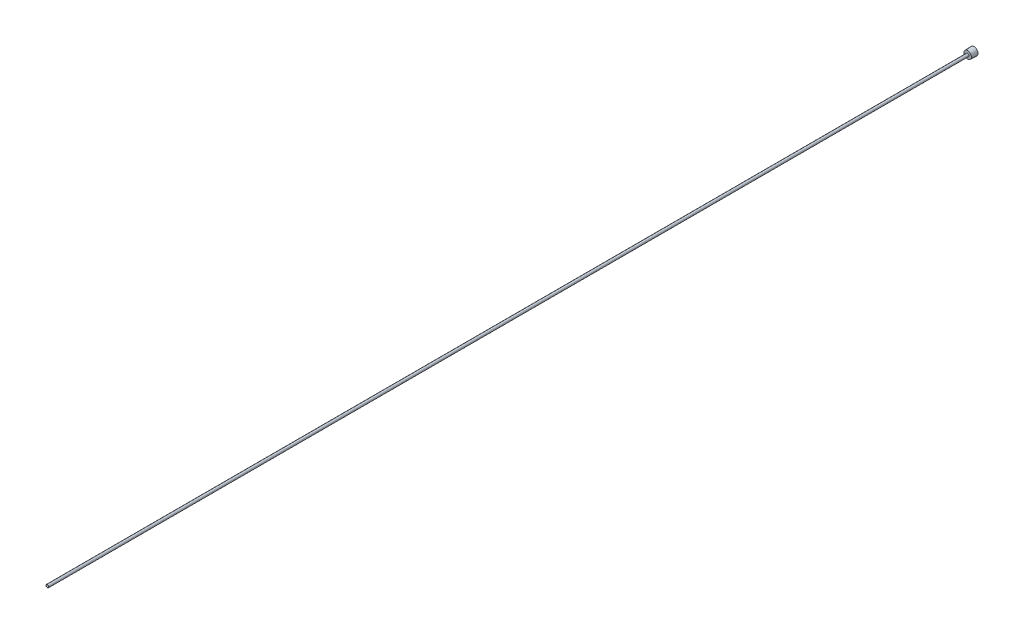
ISO-10303-21;
HEADER;
FILE_DESCRIPTION(('STEP AP214'),'2;1');
FILE_NAME('part.step','',(''),(''),'','','');
FILE_SCHEMA(('AUTOMOTIVE_DESIGN { 1 0 10303 214 1 1 1 1 }'));
ENDSEC;
DATA;
#1=APPLICATION_CONTEXT('core data for automotive mechanical design processes');
#2=APPLICATION_PROTOCOL_DEFINITION('international standard','automotive_design',2000,#1);
#3=PRODUCT_CONTEXT('',#1,'mechanical');
#4=PRODUCT('Part','Part','',(#3));
#5=PRODUCT_RELATED_PRODUCT_CATEGORY('part','',(#4));
#6=PRODUCT_DEFINITION_FORMATION('','',#4);
#7=PRODUCT_DEFINITION_CONTEXT('part definition',#1,'design');
#8=PRODUCT_DEFINITION('design','',#6,#7);
#9=PRODUCT_DEFINITION_SHAPE('','',#8);
#10=(LENGTH_UNIT() NAMED_UNIT(*) SI_UNIT(.MILLI.,.METRE.));
#11=(NAMED_UNIT(*) PLANE_ANGLE_UNIT() SI_UNIT($,.RADIAN.));
#12=(NAMED_UNIT(*) SI_UNIT($,.STERADIAN.) SOLID_ANGLE_UNIT());
#13=UNCERTAINTY_MEASURE_WITH_UNIT(LENGTH_MEASURE(1.E-05),#10,'distance_accuracy_value','');
#14=(GEOMETRIC_REPRESENTATION_CONTEXT(3) GLOBAL_UNCERTAINTY_ASSIGNED_CONTEXT((#13)) GLOBAL_UNIT_ASSIGNED_CONTEXT((#10,
#11,#12)) REPRESENTATION_CONTEXT('',''));
#15=CARTESIAN_POINT('',(0.,0.,0.));
#16=DIRECTION('',(0.,0.,1.));
#17=DIRECTION('',(1.,0.,0.));
#18=AXIS2_PLACEMENT_3D('',#15,#16,#17);
#19=CARTESIAN_POINT('',(0.,0.,0.));
#20=DIRECTION('',(0.,0.,1.));
#21=DIRECTION('',(1.,0.,0.));
#22=AXIS2_PLACEMENT_3D('',#19,#20,#21);
#23=CYLINDRICAL_SURFACE('',#22,1.2065);
#24=CARTESIAN_POINT('',(0.,0.,914.4));
#25=DIRECTION('',(0.,0.,1.));
#26=DIRECTION('',(1.,0.,0.));
#27=AXIS2_PLACEMENT_3D('',#24,#25,#26);
#28=CIRCLE('',#27,1.2065);
#29=CARTESIAN_POINT('',(1.2065,0.,914.4));
#30=VERTEX_POINT('',#29);
#31=EDGE_CURVE('E142',#30,#30,#28,.T.);
#32=ORIENTED_EDGE('',*,*,#31,.T.);
#33=EDGE_LOOP('',(#32));
#34=FACE_BOUND('',#33,.T.);
#35=CARTESIAN_POINT('',(0.,0.,3.96875));
#36=DIRECTION('',(0.,0.,-1.));
#37=DIRECTION('',(-1.,0.,0.));
#38=AXIS2_PLACEMENT_3D('',#35,#36,#37);
#39=CIRCLE('',#38,1.2065);
#40=CARTESIAN_POINT('',(-1.2065,0.,3.96875));
#41=VERTEX_POINT('',#40);
#42=EDGE_CURVE('E37',#41,#41,#39,.F.);
#43=ORIENTED_EDGE('',*,*,#42,.F.);
#44=EDGE_LOOP('',(#43));
#45=FACE_BOUND('',#44,.T.);
#46=ADVANCED_FACE('F33',(#34,#45),#23,.F.);
#47=CARTESIAN_POINT('',(0.,0.,0.));
#48=DIRECTION('',(0.,0.,1.));
#49=DIRECTION('',(1.,0.,0.));
#50=AXIS2_PLACEMENT_3D('',#47,#48,#49);
#51=PLANE('',#50);
#52=DIRECTION('',(-0.866025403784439,0.5,0.));
#53=VECTOR('',#52,1.);
#54=CARTESIAN_POINT('',(0.,-2.7569630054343,0.));
#55=LINE('',#54,#53);
#56=CARTESIAN_POINT('',(0.,-2.7569630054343,0.));
#57=VERTEX_POINT('',#56);
#58=CARTESIAN_POINT('',(-2.3876,-1.37848150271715,0.));
#59=VERTEX_POINT('',#58);
#60=EDGE_CURVE('E124',#57,#59,#55,.T.);
#61=ORIENTED_EDGE('',*,*,#60,.F.);
#62=DIRECTION('',(-0.866025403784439,-0.5,0.));
#63=VECTOR('',#62,1.);
#64=CARTESIAN_POINT('',(2.3876,-1.37848150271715,0.));
#65=LINE('',#64,#63);
#66=CARTESIAN_POINT('',(2.3876,-1.37848150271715,0.));
#67=VERTEX_POINT('',#66);
#68=EDGE_CURVE('E49',#67,#57,#65,.T.);
#69=ORIENTED_EDGE('',*,*,#68,.F.);
#70=DIRECTION('',(0.,-1.,0.));
#71=VECTOR('',#70,1.);
#72=CARTESIAN_POINT('',(2.3876,1.37848150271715,0.));
#73=LINE('',#72,#71);
#74=CARTESIAN_POINT('',(2.3876,1.37848150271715,0.));
#75=VERTEX_POINT('',#74);
#76=EDGE_CURVE('E133',#75,#67,#73,.T.);
#77=ORIENTED_EDGE('',*,*,#76,.F.);
#78=DIRECTION('',(0.866025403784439,-0.5,0.));
#79=VECTOR('',#78,1.);
#80=CARTESIAN_POINT('',(0.,2.7569630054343,0.));
#81=LINE('',#80,#79);
#82=CARTESIAN_POINT('',(0.,2.7569630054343,0.));
#83=VERTEX_POINT('',#82);
#84=EDGE_CURVE('E131',#83,#75,#81,.T.);
#85=ORIENTED_EDGE('',*,*,#84,.F.);
#86=DIRECTION('',(0.866025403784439,0.5,0.));
#87=VECTOR('',#86,1.);
#88=CARTESIAN_POINT('',(-2.3876,1.37848150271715,0.));
#89=LINE('',#88,#87);
#90=CARTESIAN_POINT('',(-2.3876,1.37848150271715,0.));
#91=VERTEX_POINT('',#90);
#92=EDGE_CURVE('E97',#91,#83,#89,.T.);
#93=ORIENTED_EDGE('',*,*,#92,.F.);
#94=DIRECTION('',(0.,1.,0.));
#95=VECTOR('',#94,1.);
#96=CARTESIAN_POINT('',(-2.3876,-1.37848150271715,0.));
#97=LINE('',#96,#95);
#98=EDGE_CURVE('E127',#59,#91,#97,.T.);
#99=ORIENTED_EDGE('',*,*,#98,.F.);
#100=EDGE_LOOP('',(#61,#69,#77,#85,#93,#99));
#101=FACE_BOUND('',#100,.T.);
#102=CARTESIAN_POINT('',(0.,0.,0.));
#103=DIRECTION('',(0.,0.,1.));
#104=DIRECTION('',(1.,0.,0.));
#105=AXIS2_PLACEMENT_3D('',#102,#103,#104);
#106=CIRCLE('',#105,3.8989);
#107=CARTESIAN_POINT('',(3.8989,0.,0.));
#108=VERTEX_POINT('',#107);
#109=EDGE_CURVE('E11',#108,#108,#106,.T.);
#110=ORIENTED_EDGE('',*,*,#109,.F.);
#111=EDGE_LOOP('',(#110));
#112=FACE_BOUND('',#111,.T.);
#113=ADVANCED_FACE('F35',(#101,#112),#51,.F.);
#114=CARTESIAN_POINT('',(0.,0.,0.));
#115=DIRECTION('',(0.,0.,-1.));
#116=DIRECTION('',(-1.,0.,0.));
#117=AXIS2_PLACEMENT_3D('',#114,#115,#116);
#118=CONICAL_SURFACE('',#117,3.8989,0.0364424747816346);
#119=CARTESIAN_POINT('',(0.,0.,6.35));
#120=DIRECTION('',(0.,0.,1.));
#121=DIRECTION('',(1.,0.,0.));
#122=AXIS2_PLACEMENT_3D('',#119,#120,#121);
#123=CIRCLE('',#122,3.66738778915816);
#124=CARTESIAN_POINT('',(3.66738778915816,0.,6.35));
#125=VERTEX_POINT('',#124);
#126=EDGE_CURVE('E42',#125,#125,#123,.T.);
#127=ORIENTED_EDGE('',*,*,#126,.F.);
#128=EDGE_LOOP('',(#127));
#129=FACE_BOUND('',#128,.T.);
#130=ORIENTED_EDGE('',*,*,#109,.T.);
#131=EDGE_LOOP('',(#130));
#132=FACE_BOUND('',#131,.T.);
#133=ADVANCED_FACE('F156',(#129,#132),#118,.T.);
#134=CARTESIAN_POINT('',(0.,3.66738778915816,6.35));
#135=DIRECTION('',(0.,0.,-1.));
#136=DIRECTION('',(-1.,0.,0.));
#137=AXIS2_PLACEMENT_3D('',#134,#135,#136);
#138=PLANE('',#137);
#139=CARTESIAN_POINT('',(0.,0.,6.35));
#140=DIRECTION('',(0.,0.,1.));
#141=DIRECTION('',(1.,0.,0.));
#142=AXIS2_PLACEMENT_3D('',#139,#140,#141);
#143=CIRCLE('',#142,1.3890625);
#144=CARTESIAN_POINT('',(1.3890625,0.,6.35));
#145=VERTEX_POINT('',#144);
#146=EDGE_CURVE('E148',#145,#145,#143,.T.);
#147=ORIENTED_EDGE('',*,*,#146,.F.);
#148=EDGE_LOOP('',(#147));
#149=FACE_BOUND('',#148,.T.);
#150=ORIENTED_EDGE('',*,*,#126,.T.);
#151=EDGE_LOOP('',(#150));
#152=FACE_BOUND('',#151,.T.);
#153=ADVANCED_FACE('F154',(#149,#152),#138,.F.);
#154=CARTESIAN_POINT('',(0.,0.,0.));
#155=DIRECTION('',(0.,0.,1.));
#156=DIRECTION('',(1.,0.,0.));
#157=AXIS2_PLACEMENT_3D('',#154,#155,#156);
#158=CYLINDRICAL_SURFACE('',#157,1.38906249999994);
#159=CARTESIAN_POINT('',(0.,0.,914.4));
#160=DIRECTION('',(0.,0.,1.));
#161=DIRECTION('',(1.,0.,0.));
#162=AXIS2_PLACEMENT_3D('',#159,#160,#161);
#163=CIRCLE('',#162,1.38906249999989);
#164=CARTESIAN_POINT('',(1.38906249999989,0.,914.4));
#165=VERTEX_POINT('',#164);
#166=EDGE_CURVE('E145',#165,#165,#163,.T.);
#167=ORIENTED_EDGE('',*,*,#166,.F.);
#168=EDGE_LOOP('',(#167));
#169=FACE_BOUND('',#168,.T.);
#170=ORIENTED_EDGE('',*,*,#146,.T.);
#171=EDGE_LOOP('',(#170));
#172=FACE_BOUND('',#171,.T.);
#173=ADVANCED_FACE('F190',(#169,#172),#158,.T.);
#174=CARTESIAN_POINT('',(0.,1.38906249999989,914.4));
#175=DIRECTION('',(0.,0.,-1.));
#176=DIRECTION('',(-1.,0.,0.));
#177=AXIS2_PLACEMENT_3D('',#174,#175,#176);
#178=PLANE('',#177);
#179=ORIENTED_EDGE('',*,*,#31,.F.);
#180=EDGE_LOOP('',(#179));
#181=FACE_BOUND('',#180,.T.);
#182=ORIENTED_EDGE('',*,*,#166,.T.);
#183=EDGE_LOOP('',(#182));
#184=FACE_BOUND('',#183,.T.);
#185=ADVANCED_FACE('F183',(#181,#184),#178,.F.);
#186=CARTESIAN_POINT('',(0.,-2.7569630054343,3.96875));
#187=DIRECTION('',(0.,0.,-1.));
#188=DIRECTION('',(-1.,0.,0.));
#189=AXIS2_PLACEMENT_3D('',#186,#187,#188);
#190=PLANE('',#189);
#191=DIRECTION('',(-0.866025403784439,-0.5,0.));
#192=VECTOR('',#191,1.);
#193=CARTESIAN_POINT('',(2.3876,-1.37848150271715,3.96875));
#194=LINE('',#193,#192);
#195=CARTESIAN_POINT('',(2.3876,-1.37848150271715,3.96875));
#196=VERTEX_POINT('',#195);
#197=CARTESIAN_POINT('',(0.,-2.7569630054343,3.96875));
#198=VERTEX_POINT('',#197);
#199=EDGE_CURVE('E135',#196,#198,#194,.T.);
#200=ORIENTED_EDGE('',*,*,#199,.T.);
#201=DIRECTION('',(-0.866025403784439,0.5,0.));
#202=VECTOR('',#201,1.);
#203=CARTESIAN_POINT('',(0.,-2.7569630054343,3.96875));
#204=LINE('',#203,#202);
#205=CARTESIAN_POINT('',(-2.3876,-1.37848150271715,3.96875));
#206=VERTEX_POINT('',#205);
#207=EDGE_CURVE('E118',#198,#206,#204,.T.);
#208=ORIENTED_EDGE('',*,*,#207,.T.);
#209=DIRECTION('',(0.,1.,0.));
#210=VECTOR('',#209,1.);
#211=CARTESIAN_POINT('',(-2.3876,-1.37848150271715,3.96875));
#212=LINE('',#211,#210);
#213=CARTESIAN_POINT('',(-2.3876,1.37848150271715,3.96875));
#214=VERTEX_POINT('',#213);
#215=EDGE_CURVE('E116',#206,#214,#212,.T.);
#216=ORIENTED_EDGE('',*,*,#215,.T.);
#217=DIRECTION('',(0.866025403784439,0.5,0.));
#218=VECTOR('',#217,1.);
#219=CARTESIAN_POINT('',(-2.3876,1.37848150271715,3.96875));
#220=LINE('',#219,#218);
#221=CARTESIAN_POINT('',(0.,2.7569630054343,3.96875));
#222=VERTEX_POINT('',#221);
#223=EDGE_CURVE('E94',#214,#222,#220,.T.);
#224=ORIENTED_EDGE('',*,*,#223,.T.);
#225=DIRECTION('',(0.866025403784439,-0.5,0.));
#226=VECTOR('',#225,1.);
#227=CARTESIAN_POINT('',(0.,2.7569630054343,3.96875));
#228=LINE('',#227,#226);
#229=CARTESIAN_POINT('',(2.3876,1.37848150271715,3.96875));
#230=VERTEX_POINT('',#229);
#231=EDGE_CURVE('E105',#222,#230,#228,.T.);
#232=ORIENTED_EDGE('',*,*,#231,.T.);
#233=DIRECTION('',(0.,-1.,0.));
#234=VECTOR('',#233,1.);
#235=CARTESIAN_POINT('',(2.3876,1.37848150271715,3.96875));
#236=LINE('',#235,#234);
#237=EDGE_CURVE('E109',#230,#196,#236,.T.);
#238=ORIENTED_EDGE('',*,*,#237,.T.);
#239=EDGE_LOOP('',(#200,#208,#216,#224,#232,#238));
#240=FACE_BOUND('',#239,.T.);
#241=ORIENTED_EDGE('',*,*,#42,.T.);
#242=EDGE_LOOP('',(#241));
#243=FACE_BOUND('',#242,.T.);
#244=ADVANCED_FACE('F112',(#240,#243),#190,.T.);
#245=CARTESIAN_POINT('',(2.3876,-1.37848150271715,3.96875));
#246=DIRECTION('',(0.5,-0.866025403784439,0.));
#247=DIRECTION('',(0.866025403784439,0.5,0.));
#248=AXIS2_PLACEMENT_3D('',#245,#246,#247);
#249=PLANE('',#248);
#250=ORIENTED_EDGE('',*,*,#68,.T.);
#251=DIRECTION('',(0.,0.,-1.));
#252=VECTOR('',#251,1.);
#253=CARTESIAN_POINT('',(0.,-2.7569630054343,3.96875));
#254=LINE('',#253,#252);
#255=EDGE_CURVE('E79',#198,#57,#254,.T.);
#256=ORIENTED_EDGE('',*,*,#255,.F.);
#257=ORIENTED_EDGE('',*,*,#199,.F.);
#258=DIRECTION('',(0.,0.,-1.));
#259=VECTOR('',#258,1.);
#260=CARTESIAN_POINT('',(2.3876,-1.37848150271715,3.96875));
#261=LINE('',#260,#259);
#262=EDGE_CURVE('E57',#196,#67,#261,.T.);
#263=ORIENTED_EDGE('',*,*,#262,.T.);
#264=EDGE_LOOP('',(#250,#256,#257,#263));
#265=FACE_BOUND('',#264,.T.);
#266=ADVANCED_FACE('F174',(#265),#249,.F.);
#267=CARTESIAN_POINT('',(2.3876,1.37848150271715,3.96875));
#268=DIRECTION('',(1.,0.,0.));
#269=DIRECTION('',(0.,0.,-1.));
#270=AXIS2_PLACEMENT_3D('',#267,#268,#269);
#271=PLANE('',#270);
#272=ORIENTED_EDGE('',*,*,#76,.T.);
#273=ORIENTED_EDGE('',*,*,#262,.F.);
#274=ORIENTED_EDGE('',*,*,#237,.F.);
#275=DIRECTION('',(0.,0.,-1.));
#276=VECTOR('',#275,1.);
#277=CARTESIAN_POINT('',(2.3876,1.37848150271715,3.96875));
#278=LINE('',#277,#276);
#279=EDGE_CURVE('E101',#230,#75,#278,.T.);
#280=ORIENTED_EDGE('',*,*,#279,.T.);
#281=EDGE_LOOP('',(#272,#273,#274,#280));
#282=FACE_BOUND('',#281,.T.);
#283=ADVANCED_FACE('F176',(#282),#271,.F.);
#284=CARTESIAN_POINT('',(0.,2.7569630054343,3.96875));
#285=DIRECTION('',(0.5,0.866025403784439,0.));
#286=DIRECTION('',(-0.866025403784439,0.5,0.));
#287=AXIS2_PLACEMENT_3D('',#284,#285,#286);
#288=PLANE('',#287);
#289=ORIENTED_EDGE('',*,*,#84,.T.);
#290=ORIENTED_EDGE('',*,*,#279,.F.);
#291=ORIENTED_EDGE('',*,*,#231,.F.);
#292=DIRECTION('',(0.,0.,-1.));
#293=VECTOR('',#292,1.);
#294=CARTESIAN_POINT('',(0.,2.7569630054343,3.96875));
#295=LINE('',#294,#293);
#296=EDGE_CURVE('E90',#222,#83,#295,.T.);
#297=ORIENTED_EDGE('',*,*,#296,.T.);
#298=EDGE_LOOP('',(#289,#290,#291,#297));
#299=FACE_BOUND('',#298,.T.);
#300=ADVANCED_FACE('F106',(#299),#288,.F.);
#301=CARTESIAN_POINT('',(-2.3876,1.37848150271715,3.96875));
#302=DIRECTION('',(-0.5,0.866025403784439,0.));
#303=DIRECTION('',(-0.866025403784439,-0.5,0.));
#304=AXIS2_PLACEMENT_3D('',#301,#302,#303);
#305=PLANE('',#304);
#306=ORIENTED_EDGE('',*,*,#92,.T.);
#307=ORIENTED_EDGE('',*,*,#296,.F.);
#308=ORIENTED_EDGE('',*,*,#223,.F.);
#309=DIRECTION('',(0.,0.,-1.));
#310=VECTOR('',#309,1.);
#311=CARTESIAN_POINT('',(-2.3876,1.37848150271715,3.96875));
#312=LINE('',#311,#310);
#313=EDGE_CURVE('E102',#214,#91,#312,.T.);
#314=ORIENTED_EDGE('',*,*,#313,.T.);
#315=EDGE_LOOP('',(#306,#307,#308,#314));
#316=FACE_BOUND('',#315,.T.);
#317=ADVANCED_FACE('F92',(#316),#305,.F.);
#318=CARTESIAN_POINT('',(-2.3876,-1.37848150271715,3.96875));
#319=DIRECTION('',(-1.,0.,0.));
#320=DIRECTION('',(0.,-1.,0.));
#321=AXIS2_PLACEMENT_3D('',#318,#319,#320);
#322=PLANE('',#321);
#323=ORIENTED_EDGE('',*,*,#98,.T.);
#324=ORIENTED_EDGE('',*,*,#313,.F.);
#325=ORIENTED_EDGE('',*,*,#215,.F.);
#326=DIRECTION('',(0.,0.,-1.));
#327=VECTOR('',#326,1.);
#328=CARTESIAN_POINT('',(-2.3876,-1.37848150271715,3.96875));
#329=LINE('',#328,#327);
#330=EDGE_CURVE('E139',#206,#59,#329,.T.);
#331=ORIENTED_EDGE('',*,*,#330,.T.);
#332=EDGE_LOOP('',(#323,#324,#325,#331));
#333=FACE_BOUND('',#332,.T.);
#334=ADVANCED_FACE('F246',(#333),#322,.F.);
#335=CARTESIAN_POINT('',(0.,-2.7569630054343,3.96875));
#336=DIRECTION('',(-0.5,-0.866025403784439,0.));
#337=DIRECTION('',(0.866025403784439,-0.5,0.));
#338=AXIS2_PLACEMENT_3D('',#335,#336,#337);
#339=PLANE('',#338);
#340=ORIENTED_EDGE('',*,*,#60,.T.);
#341=ORIENTED_EDGE('',*,*,#330,.F.);
#342=ORIENTED_EDGE('',*,*,#207,.F.);
#343=ORIENTED_EDGE('',*,*,#255,.T.);
#344=EDGE_LOOP('',(#340,#341,#342,#343));
#345=FACE_BOUND('',#344,.T.);
#346=ADVANCED_FACE('F172',(#345),#339,.F.);
#347=CLOSED_SHELL('',(#46,#113,#133,#153,#173,#185,#244,#266,#283,#300,#317,#334,#346));
#348=MANIFOLD_SOLID_BREP('B2',#347);
#349=ADVANCED_BREP_SHAPE_REPRESENTATION('',(#18,#348),#14);
#350=SHAPE_DEFINITION_REPRESENTATION(#9,#349);
ENDSEC;
END-ISO-10303-21;
